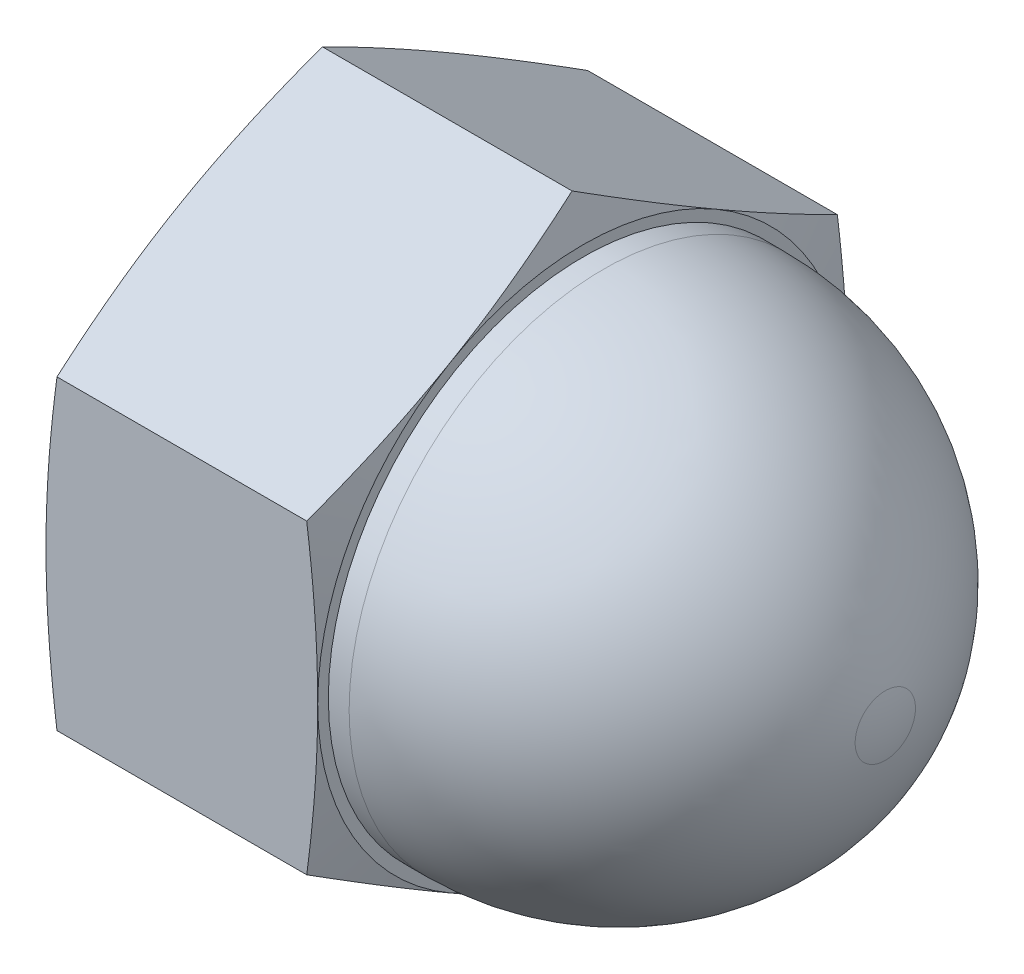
ISO-10303-21;
HEADER;
FILE_DESCRIPTION(('STEP AP214'),'2;1');
FILE_NAME('part.step','',(''),(''),'','','');
FILE_SCHEMA(('AUTOMOTIVE_DESIGN { 1 0 10303 214 1 1 1 1 }'));
ENDSEC;
DATA;
#1=APPLICATION_CONTEXT('core data for automotive mechanical design processes');
#2=APPLICATION_PROTOCOL_DEFINITION('international standard','automotive_design',2000,#1);
#3=PRODUCT_CONTEXT('',#1,'mechanical');
#4=PRODUCT('Part','Part','',(#3));
#5=PRODUCT_RELATED_PRODUCT_CATEGORY('part','',(#4));
#6=PRODUCT_DEFINITION_FORMATION('','',#4);
#7=PRODUCT_DEFINITION_CONTEXT('part definition',#1,'design');
#8=PRODUCT_DEFINITION('design','',#6,#7);
#9=PRODUCT_DEFINITION_SHAPE('','',#8);
#10=(LENGTH_UNIT() NAMED_UNIT(*) SI_UNIT(.MILLI.,.METRE.));
#11=(NAMED_UNIT(*) PLANE_ANGLE_UNIT() SI_UNIT($,.RADIAN.));
#12=(NAMED_UNIT(*) SI_UNIT($,.STERADIAN.) SOLID_ANGLE_UNIT());
#13=UNCERTAINTY_MEASURE_WITH_UNIT(LENGTH_MEASURE(1.E-05),#10,'distance_accuracy_value','');
#14=(GEOMETRIC_REPRESENTATION_CONTEXT(3) GLOBAL_UNCERTAINTY_ASSIGNED_CONTEXT((#13)) GLOBAL_UNIT_ASSIGNED_CONTEXT((#10,
#11,#12)) REPRESENTATION_CONTEXT('',''));
#15=CARTESIAN_POINT('',(0.,0.,0.));
#16=DIRECTION('',(0.,0.,1.));
#17=DIRECTION('',(1.,0.,0.));
#18=AXIS2_PLACEMENT_3D('',#15,#16,#17);
#19=CARTESIAN_POINT('',(0.,2.29135888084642,3.96875));
#20=DIRECTION('',(1.,0.,0.));
#21=DIRECTION('',(0.,0.,-1.));
#22=AXIS2_PLACEMENT_3D('',#19,#20,#21);
#23=PLANE('',#22);
#24=CARTESIAN_POINT('',(0.,0.,0.));
#25=DIRECTION('',(1.,0.,0.));
#26=DIRECTION('',(0.,0.,-1.));
#27=AXIS2_PLACEMENT_3D('',#24,#25,#26);
#28=CIRCLE('',#27,2.0828);
#29=CARTESIAN_POINT('',(0.,0.,-2.0828));
#30=VERTEX_POINT('',#29);
#31=EDGE_CURVE('E40',#30,#30,#28,.T.);
#32=ORIENTED_EDGE('',*,*,#31,.T.);
#33=EDGE_LOOP('',(#32));
#34=FACE_BOUND('',#33,.T.);
#35=CARTESIAN_POINT('',(0.,0.,0.));
#36=DIRECTION('',(1.,0.,0.));
#37=DIRECTION('',(0.,0.,-1.));
#38=AXIS2_PLACEMENT_3D('',#35,#36,#37);
#39=CIRCLE('',#38,3.96875);
#40=CARTESIAN_POINT('',(0.,0.,-3.96875));
#41=VERTEX_POINT('',#40);
#42=CARTESIAN_POINT('',(0.,3.43703832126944,-1.98437500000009));
#43=VERTEX_POINT('',#42);
#44=EDGE_CURVE('E182',#41,#43,#39,.T.);
#45=ORIENTED_EDGE('',*,*,#44,.F.);
#46=CARTESIAN_POINT('',(0.,-3.43703832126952,-1.98437499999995));
#47=VERTEX_POINT('',#46);
#48=EDGE_CURVE('E183',#47,#41,#39,.T.);
#49=ORIENTED_EDGE('',*,*,#48,.F.);
#50=CARTESIAN_POINT('',(0.,-3.43703832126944,1.98437500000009));
#51=VERTEX_POINT('',#50);
#52=EDGE_CURVE('E342',#51,#47,#39,.T.);
#53=ORIENTED_EDGE('',*,*,#52,.F.);
#54=CARTESIAN_POINT('',(0.,0.,3.96875));
#55=VERTEX_POINT('',#54);
#56=EDGE_CURVE('E387',#55,#51,#39,.T.);
#57=ORIENTED_EDGE('',*,*,#56,.F.);
#58=CARTESIAN_POINT('',(0.,0.,0.));
#59=DIRECTION('',(-1.,0.,0.));
#60=DIRECTION('',(0.,0.,1.));
#61=AXIS2_PLACEMENT_3D('',#58,#59,#60);
#62=CIRCLE('',#61,3.96875);
#63=CARTESIAN_POINT('',(0.,3.43703832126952,1.98437499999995));
#64=VERTEX_POINT('',#63);
#65=EDGE_CURVE('E292',#55,#64,#62,.T.);
#66=ORIENTED_EDGE('',*,*,#65,.T.);
#67=EDGE_CURVE('E386',#43,#64,#39,.T.);
#68=ORIENTED_EDGE('',*,*,#67,.F.);
#69=EDGE_LOOP('',(#45,#49,#53,#57,#66,#68));
#70=FACE_BOUND('',#69,.T.);
#71=ADVANCED_FACE('F35',(#34,#70),#23,.F.);
#72=CARTESIAN_POINT('',(4.064,2.29135888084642,3.96875));
#73=DIRECTION('',(1.,0.,0.));
#74=DIRECTION('',(0.,0.,-1.));
#75=AXIS2_PLACEMENT_3D('',#72,#73,#74);
#76=PLANE('',#75);
#77=CARTESIAN_POINT('',(4.064,0.,0.));
#78=DIRECTION('',(1.,0.,0.));
#79=DIRECTION('',(0.,0.,-1.));
#80=AXIS2_PLACEMENT_3D('',#77,#78,#79);
#81=CIRCLE('',#80,3.81);
#82=CARTESIAN_POINT('',(4.064,0.,-3.81));
#83=VERTEX_POINT('',#82);
#84=EDGE_CURVE('E369',#83,#83,#81,.F.);
#85=ORIENTED_EDGE('',*,*,#84,.T.);
#86=EDGE_LOOP('',(#85));
#87=FACE_BOUND('',#86,.T.);
#88=CARTESIAN_POINT('',(4.064,0.,0.));
#89=DIRECTION('',(-1.,0.,0.));
#90=DIRECTION('',(0.,0.,1.));
#91=AXIS2_PLACEMENT_3D('',#88,#89,#90);
#92=CIRCLE('',#91,3.96875);
#93=CARTESIAN_POINT('',(4.064,0.,-3.96875));
#94=VERTEX_POINT('',#93);
#95=CARTESIAN_POINT('',(4.064,-3.43703832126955,-1.98437499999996));
#96=VERTEX_POINT('',#95);
#97=EDGE_CURVE('E289',#94,#96,#92,.T.);
#98=ORIENTED_EDGE('',*,*,#97,.F.);
#99=CARTESIAN_POINT('',(4.064,3.43703832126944,-1.98437500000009));
#100=VERTEX_POINT('',#99);
#101=EDGE_CURVE('E291',#100,#94,#92,.T.);
#102=ORIENTED_EDGE('',*,*,#101,.F.);
#103=CARTESIAN_POINT('',(4.064,3.43703832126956,1.98437499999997));
#104=VERTEX_POINT('',#103);
#105=EDGE_CURVE('E295',#104,#100,#92,.T.);
#106=ORIENTED_EDGE('',*,*,#105,.F.);
#107=CARTESIAN_POINT('',(4.064,0.,3.96875));
#108=VERTEX_POINT('',#107);
#109=EDGE_CURVE('E293',#108,#104,#92,.T.);
#110=ORIENTED_EDGE('',*,*,#109,.F.);
#111=CARTESIAN_POINT('',(4.064,-3.43703832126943,1.98437500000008));
#112=VERTEX_POINT('',#111);
#113=EDGE_CURVE('E53',#112,#108,#92,.T.);
#114=ORIENTED_EDGE('',*,*,#113,.F.);
#115=EDGE_CURVE('E61',#96,#112,#92,.T.);
#116=ORIENTED_EDGE('',*,*,#115,.F.);
#117=EDGE_LOOP('',(#98,#102,#106,#110,#114,#116));
#118=FACE_BOUND('',#117,.T.);
#119=ADVANCED_FACE('F146',(#87,#118),#76,.T.);
#120=CARTESIAN_POINT('',(4.3751590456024,0.,0.));
#121=DIRECTION('',(-1.,0.,0.));
#122=DIRECTION('',(0.,0.,1.));
#123=AXIS2_PLACEMENT_3D('',#120,#121,#122);
#124=DEGENERATE_TOROIDAL_SURFACE('',#123,0.508000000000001,4.318,.F.);
#125=CARTESIAN_POINT('',(4.3751590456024,0.,0.));
#126=DIRECTION('',(-1.,0.,0.));
#127=DIRECTION('',(0.,0.,1.));
#128=AXIS2_PLACEMENT_3D('',#125,#126,#127);
#129=CIRCLE('',#128,3.81);
#130=CARTESIAN_POINT('',(4.3751590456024,0.,3.81));
#131=VERTEX_POINT('',#130);
#132=EDGE_CURVE('E555',#131,#131,#129,.T.);
#133=ORIENTED_EDGE('',*,*,#132,.F.);
#134=EDGE_LOOP('',(#133));
#135=FACE_BOUND('',#134,.T.);
#136=CARTESIAN_POINT('',(8.58519195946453,0.,0.));
#137=DIRECTION('',(-1.,0.,0.));
#138=DIRECTION('',(0.,0.,1.));
#139=AXIS2_PLACEMENT_3D('',#136,#137,#138);
#140=CIRCLE('',#139,0.451555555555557);
#141=CARTESIAN_POINT('',(8.58519195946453,0.,0.451555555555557));
#142=VERTEX_POINT('',#141);
#143=EDGE_CURVE('E558',#142,#142,#140,.T.);
#144=ORIENTED_EDGE('',*,*,#143,.T.);
#145=EDGE_LOOP('',(#144));
#146=FACE_BOUND('',#145,.T.);
#147=ADVANCED_FACE('F152',(#135,#146),#124,.F.);
#148=CARTESIAN_POINT('',(0.,0.,0.));
#149=DIRECTION('',(-1.,0.,0.));
#150=DIRECTION('',(0.,0.,1.));
#151=AXIS2_PLACEMENT_3D('',#148,#149,#150);
#152=CYLINDRICAL_SURFACE('',#151,3.81);
#153=ORIENTED_EDGE('',*,*,#84,.F.);
#154=EDGE_LOOP('',(#153));
#155=FACE_BOUND('',#154,.T.);
#156=ORIENTED_EDGE('',*,*,#132,.T.);
#157=EDGE_LOOP('',(#156));
#158=FACE_BOUND('',#157,.T.);
#159=ADVANCED_FACE('F398',(#155,#158),#152,.T.);
#160=CARTESIAN_POINT('',(6.604,0.,0.));
#161=DIRECTION('',(-1.,0.,0.));
#162=DIRECTION('',(0.,-1.,0.));
#163=AXIS2_PLACEMENT_3D('',#160,#161,#162);
#164=SPHERICAL_SURFACE('',#163,2.032);
#165=ORIENTED_EDGE('',*,*,#143,.F.);
#166=EDGE_LOOP('',(#165));
#167=FACE_BOUND('',#166,.T.);
#168=ADVANCED_FACE('F195',(#167),#164,.T.);
#169=CARTESIAN_POINT('',(2.70107064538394,0.,0.));
#170=DIRECTION('',(-1.,0.,0.));
#171=DIRECTION('',(0.,0.,1.));
#172=AXIS2_PLACEMENT_3D('',#169,#170,#171);
#173=CONICAL_SURFACE('',#172,9.05619537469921,1.30904233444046);
#174=CARTESIAN_POINT('',(3.89948677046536,4.58283323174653,-0.000200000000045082));
#175=CARTESIAN_POINT('',(3.9249928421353,4.48766917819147,0.164628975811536));
#176=CARTESIAN_POINT('',(3.94814818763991,4.39233263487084,0.329756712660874));
#177=CARTESIAN_POINT('',(3.98883000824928,4.20132295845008,0.660595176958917));
#178=CARTESIAN_POINT('',(4.00635419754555,4.10564970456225,0.826306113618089));
#179=CARTESIAN_POINT('',(4.03475064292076,3.91454650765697,1.15730656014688));
#180=CARTESIAN_POINT('',(4.0456567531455,3.819117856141,1.32259383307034));
#181=CARTESIAN_POINT('',(4.06028073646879,3.62813889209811,1.6533791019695));
#182=CARTESIAN_POINT('',(4.06399999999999,3.53258860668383,1.81887705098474));
#183=CARTESIAN_POINT('',(4.06399999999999,3.34148803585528,2.14987294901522));
#184=CARTESIAN_POINT('',(4.06028073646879,3.24593775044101,2.31537089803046));
#185=CARTESIAN_POINT('',(4.0456567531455,3.05495878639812,2.64615616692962));
#186=CARTESIAN_POINT('',(4.03475064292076,2.95953013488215,2.81144343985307));
#187=CARTESIAN_POINT('',(4.00635419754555,2.76842693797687,3.14244388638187));
#188=CARTESIAN_POINT('',(3.98883000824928,2.67275368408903,3.30815482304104));
#189=CARTESIAN_POINT('',(3.94814818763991,2.48174400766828,3.63899328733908));
#190=CARTESIAN_POINT('',(3.9249928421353,2.38640746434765,3.80412102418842));
#191=CARTESIAN_POINT('',(3.89948677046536,2.29124341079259,3.96895));
#192=B_SPLINE_CURVE_WITH_KNOTS('',3,(#174,#175,#176,#177,#178,#179,#180,#181,#182,#183,#184,
#185,#186,#187,#188,#189,#190,#191),.UNSPECIFIED.,.F.,.F.,(4,2,2,2,2,2,2,2,4),(0.,
0.57611882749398,1.15247121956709,1.72584992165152,2.2991176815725,2.87238544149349,
3.44576414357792,4.02211653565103,4.59823536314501),.UNSPECIFIED.);
#193=CARTESIAN_POINT('',(3.8995177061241,4.5827177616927,0.));
#194=VERTEX_POINT('',#193);
#195=EDGE_CURVE('E210',#194,#104,#192,.T.);
#196=ORIENTED_EDGE('',*,*,#195,.T.);
#197=ORIENTED_EDGE('',*,*,#105,.T.);
#198=CARTESIAN_POINT('',(3.89948677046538,2.29124341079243,-3.96895));
#199=CARTESIAN_POINT('',(3.92499284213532,2.3864074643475,-3.80412102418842));
#200=CARTESIAN_POINT('',(3.94814818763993,2.48174400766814,-3.63899328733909));
#201=CARTESIAN_POINT('',(3.9888300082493,2.6727536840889,-3.30815482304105));
#202=CARTESIAN_POINT('',(4.00635419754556,2.76842693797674,-3.14244388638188));
#203=CARTESIAN_POINT('',(4.03475064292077,2.95953013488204,-2.8114434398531));
#204=CARTESIAN_POINT('',(4.04565675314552,3.05495878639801,-2.64615616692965));
#205=CARTESIAN_POINT('',(4.06028073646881,3.24593775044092,-2.31537089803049));
#206=CARTESIAN_POINT('',(4.064,3.3414880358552,-2.14987294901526));
#207=CARTESIAN_POINT('',(4.064,3.53258860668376,-1.81887705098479));
#208=CARTESIAN_POINT('',(4.06028073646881,3.62813889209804,-1.65337910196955));
#209=CARTESIAN_POINT('',(4.04565675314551,3.81911785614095,-1.3225938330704));
#210=CARTESIAN_POINT('',(4.03475064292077,3.91454650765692,-1.15730656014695));
#211=CARTESIAN_POINT('',(4.00635419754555,4.10564970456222,-0.82630611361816));
#212=CARTESIAN_POINT('',(3.98883000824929,4.20132295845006,-0.660595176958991));
#213=CARTESIAN_POINT('',(3.94814818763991,4.39233263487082,-0.329756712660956));
#214=CARTESIAN_POINT('',(3.9249928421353,4.48766917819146,-0.164628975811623));
#215=CARTESIAN_POINT('',(3.89948677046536,4.58283323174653,0.000199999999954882));
#216=B_SPLINE_CURVE_WITH_KNOTS('',3,(#198,#199,#200,#201,#202,#203,#204,#205,#206,#207,#208,
#209,#210,#211,#212,#213,#214,#215),.UNSPECIFIED.,.F.,.F.,(4,2,2,2,2,2,2,2,4),(0.,
0.576118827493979,1.15247121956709,1.72584992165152,2.2991176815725,2.87238544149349,
3.44576414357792,4.02211653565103,4.59823536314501),.UNSPECIFIED.);
#217=EDGE_CURVE('E45',#100,#194,#216,.T.);
#218=ORIENTED_EDGE('',*,*,#217,.T.);
#219=EDGE_LOOP('',(#196,#197,#218));
#220=FACE_BOUND('',#219,.T.);
#221=ADVANCED_FACE('F191',(#220),#173,.T.);
#222=CARTESIAN_POINT('',(3.89951770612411,2.29135888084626,-3.96875));
#223=VERTEX_POINT('',#222);
#224=EDGE_CURVE('E11',#223,#100,#216,.T.);
#225=ORIENTED_EDGE('',*,*,#224,.T.);
#226=ORIENTED_EDGE('',*,*,#101,.T.);
#227=CARTESIAN_POINT('',(3.16755280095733,-6.14470752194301,-3.96875));
#228=CARTESIAN_POINT('',(3.20828431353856,-5.9636649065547,-3.96875));
#229=CARTESIAN_POINT('',(3.24853135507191,-5.7825113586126,-3.96875));
#230=CARTESIAN_POINT('',(3.3277948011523,-5.41992772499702,-3.96875));
#231=CARTESIAN_POINT('',(3.36681115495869,-5.23849762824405,-3.96875));
#232=CARTESIAN_POINT('',(3.44338277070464,-4.87515676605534,-3.96875));
#233=CARTESIAN_POINT('',(3.48093667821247,-4.69324571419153,-3.96875));
#234=CARTESIAN_POINT('',(3.55419142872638,-4.32905106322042,-3.96875));
#235=CARTESIAN_POINT('',(3.58989228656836,-4.14676746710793,-3.96875));
#236=CARTESIAN_POINT('',(3.65871398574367,-3.78326091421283,-3.96875));
#237=CARTESIAN_POINT('',(3.69185359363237,-3.60204152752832,-3.96875));
#238=CARTESIAN_POINT('',(3.75533003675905,-3.23911337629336,-3.96875));
#239=CARTESIAN_POINT('',(3.78566693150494,-3.05740462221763,-3.96875));
#240=CARTESIAN_POINT('',(3.84287264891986,-2.69345279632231,-3.96875));
#241=CARTESIAN_POINT('',(3.86974175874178,-2.51120977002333,-3.96875));
#242=CARTESIAN_POINT('',(3.91923600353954,-2.14613902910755,-3.96875));
#243=CARTESIAN_POINT('',(3.94186107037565,-1.96331130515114,-3.96875));
#244=CARTESIAN_POINT('',(3.98224597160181,-1.59496637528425,-3.96875));
#245=CARTESIAN_POINT('',(3.99994637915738,-1.40944255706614,-3.96875));
#246=CARTESIAN_POINT('',(4.02926987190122,-1.0379232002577,-3.96875));
#247=CARTESIAN_POINT('',(4.04089349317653,-0.851927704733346,-3.96875));
#248=CARTESIAN_POINT('',(4.05738881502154,-0.479721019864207,-3.96875));
#249=CARTESIAN_POINT('',(4.06226375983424,-0.293509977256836,-3.96875));
#250=CARTESIAN_POINT('',(4.06495959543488,0.0789637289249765,-3.96875));
#251=CARTESIAN_POINT('',(4.0627805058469,0.265226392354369,-3.96875));
#252=CARTESIAN_POINT('',(4.05148804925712,0.638274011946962,-3.96875));
#253=CARTESIAN_POINT('',(4.04234730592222,0.825058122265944,-3.96875));
#254=CARTESIAN_POINT('',(4.01765826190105,1.19819852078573,-3.96875));
#255=CARTESIAN_POINT('',(4.00210981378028,1.38455479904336,-3.96875));
#256=CARTESIAN_POINT('',(3.96541106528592,1.7568386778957,-3.96875));
#257=CARTESIAN_POINT('',(3.94425682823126,1.94276588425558,-3.96875));
#258=CARTESIAN_POINT('',(3.89725225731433,2.31401836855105,-3.96875));
#259=CARTESIAN_POINT('',(3.87140191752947,2.49934364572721,-3.96875));
#260=CARTESIAN_POINT('',(3.81491262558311,2.87570961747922,-3.96875));
#261=CARTESIAN_POINT('',(3.78414063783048,3.06673015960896,-3.96875));
#262=CARTESIAN_POINT('',(3.71930087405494,3.44821402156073,-3.96875));
#263=CARTESIAN_POINT('',(3.68523297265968,3.63867731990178,-3.96875));
#264=CARTESIAN_POINT('',(3.61446528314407,4.01913679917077,-3.96875));
#265=CARTESIAN_POINT('',(3.5777651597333,4.20913291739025,-3.96875));
#266=CARTESIAN_POINT('',(3.50226152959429,4.58870789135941,-3.96875));
#267=CARTESIAN_POINT('',(3.46345798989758,4.77828674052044,-3.96875));
#268=CARTESIAN_POINT('',(3.34451485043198,5.34661341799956,-3.96875));
#269=CARTESIAN_POINT('',(3.26186494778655,5.72483500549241,-3.96875));
#270=CARTESIAN_POINT('',(3.09218916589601,6.48029469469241,-3.96875));
#271=CARTESIAN_POINT('',(3.00516317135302,6.85753277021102,-3.96875));
#272=CARTESIAN_POINT('',(2.82913093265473,7.60698906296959,-3.96875));
#273=CARTESIAN_POINT('',(2.74015876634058,7.97921530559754,-3.96875));
#274=CARTESIAN_POINT('',(2.56014248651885,8.7231747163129,-3.96875));
#275=CARTESIAN_POINT('',(2.46909832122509,9.09490787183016,-3.96875));
#276=CARTESIAN_POINT('',(2.28564695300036,9.83743616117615,-3.96875));
#277=CARTESIAN_POINT('',(2.19324203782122,10.2082318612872,-3.96875));
#278=CARTESIAN_POINT('',(2.00729188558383,10.949522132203,-3.96875));
#279=CARTESIAN_POINT('',(1.9137466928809,11.3200167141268,-3.96875));
#280=CARTESIAN_POINT('',(1.81980674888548,11.6904099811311,-3.96875));
#281=B_SPLINE_CURVE_WITH_KNOTS('',3,(#227,#228,#229,#230,#231,#232,#233,#234,#235,#236,#237,
#238,#239,#240,#241,#242,#243,#244,#245,#246,#247,#248,#249,#250,#251,#252,#253,#254,#255,#256,
#257,#258,#259,#260,#261,#262,#263,#264,#265,#266,#267,#268,#269,#270,#271,#272,#273,#274,#275,
#276,#277,#278,#279,#280),.UNSPECIFIED.,.F.,.F.,(4,2,2,2,2,2,2,2,2,2,2,2,2,2,2,2,2,2,2,2,2,2,2,
2,2,2,4),(0.,0.556706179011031,1.11343528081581,1.67066829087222,2.22789683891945,
2.7805530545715,3.33319753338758,3.88579622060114,4.43840377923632,4.99741601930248,
5.55637893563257,6.1150730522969,6.67376561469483,7.2346666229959,7.79558053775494,
8.35688940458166,8.91819897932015,9.49861267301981,10.0790484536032,10.6595583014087,
11.2400772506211,12.4014705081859,13.5628943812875,14.7110215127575,15.8591773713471,
17.0055841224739,18.1519464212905),.UNSPECIFIED.);
#282=EDGE_CURVE('E203',#223,#94,#281,.F.);
#283=ORIENTED_EDGE('',*,*,#282,.F.);
#284=EDGE_LOOP('',(#225,#226,#283));
#285=FACE_BOUND('',#284,.T.);
#286=ADVANCED_FACE('F186',(#285),#173,.T.);
#287=CARTESIAN_POINT('',(3.89948677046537,-4.58283323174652,0.000200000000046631));
#288=CARTESIAN_POINT('',(3.92499284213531,-4.48766917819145,-0.164628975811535));
#289=CARTESIAN_POINT('',(3.94814818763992,-4.39233263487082,-0.329756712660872));
#290=CARTESIAN_POINT('',(3.98883000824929,-4.20132295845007,-0.660595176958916));
#291=CARTESIAN_POINT('',(4.00635419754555,-4.10564970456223,-0.826306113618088));
#292=CARTESIAN_POINT('',(4.03475064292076,-3.91454650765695,-1.15730656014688));
#293=CARTESIAN_POINT('',(4.04565675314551,-3.81911785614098,-1.32259383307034));
#294=CARTESIAN_POINT('',(4.0602807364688,-3.62813889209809,-1.6533791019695));
#295=CARTESIAN_POINT('',(4.06399999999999,-3.53258860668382,-1.81887705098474));
#296=CARTESIAN_POINT('',(4.06399999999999,-3.34148803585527,-2.14987294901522));
#297=CARTESIAN_POINT('',(4.0602807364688,-3.24593775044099,-2.31537089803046));
#298=CARTESIAN_POINT('',(4.04565675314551,-3.0549587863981,-2.64615616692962));
#299=CARTESIAN_POINT('',(4.03475064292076,-2.95953013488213,-2.81144343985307));
#300=CARTESIAN_POINT('',(4.00635419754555,-2.76842693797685,-3.14244388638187));
#301=CARTESIAN_POINT('',(3.98883000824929,-2.67275368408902,-3.30815482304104));
#302=CARTESIAN_POINT('',(3.94814818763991,-2.48174400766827,-3.63899328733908));
#303=CARTESIAN_POINT('',(3.9249928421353,-2.38640746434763,-3.80412102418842));
#304=CARTESIAN_POINT('',(3.89948677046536,-2.29124341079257,-3.96895));
#305=B_SPLINE_CURVE_WITH_KNOTS('',3,(#287,#288,#289,#290,#291,#292,#293,#294,#295,#296,#297,
#298,#299,#300,#301,#302,#303,#304),.UNSPECIFIED.,.F.,.F.,(4,2,2,2,2,2,2,2,4),(0.,
0.57611882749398,1.15247121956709,1.72584992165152,2.2991176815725,2.87238544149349,
3.44576414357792,4.02211653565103,4.59823536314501),.UNSPECIFIED.);
#306=CARTESIAN_POINT('',(3.8995177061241,-2.29135888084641,-3.96875));
#307=VERTEX_POINT('',#306);
#308=EDGE_CURVE('E215',#96,#307,#305,.T.);
#309=ORIENTED_EDGE('',*,*,#308,.T.);
#310=EDGE_CURVE('E267',#94,#307,#281,.F.);
#311=ORIENTED_EDGE('',*,*,#310,.F.);
#312=ORIENTED_EDGE('',*,*,#97,.T.);
#313=EDGE_LOOP('',(#309,#311,#312));
#314=FACE_BOUND('',#313,.T.);
#315=ADVANCED_FACE('F190',(#314),#173,.T.);
#316=CARTESIAN_POINT('',(3.89948677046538,-2.29124341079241,3.96895));
#317=CARTESIAN_POINT('',(3.92499284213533,-2.38640746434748,3.80412102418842));
#318=CARTESIAN_POINT('',(3.94814818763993,-2.48174400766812,3.63899328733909));
#319=CARTESIAN_POINT('',(3.98883000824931,-2.67275368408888,3.30815482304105));
#320=CARTESIAN_POINT('',(4.00635419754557,-2.76842693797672,3.14244388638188));
#321=CARTESIAN_POINT('',(4.03475064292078,-2.95953013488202,2.8114434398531));
#322=CARTESIAN_POINT('',(4.04565675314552,-3.054958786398,2.64615616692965));
#323=CARTESIAN_POINT('',(4.06028073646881,-3.2459377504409,2.31537089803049));
#324=CARTESIAN_POINT('',(4.06400000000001,-3.34148803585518,2.14987294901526));
#325=CARTESIAN_POINT('',(4.064,-3.53258860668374,1.81887705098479));
#326=CARTESIAN_POINT('',(4.06028073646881,-3.62813889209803,1.65337910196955));
#327=CARTESIAN_POINT('',(4.04565675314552,-3.81911785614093,1.3225938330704));
#328=CARTESIAN_POINT('',(4.03475064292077,-3.91454650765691,1.15730656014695));
#329=CARTESIAN_POINT('',(4.00635419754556,-4.1056497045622,0.82630611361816));
#330=CARTESIAN_POINT('',(3.98883000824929,-4.20132295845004,0.660595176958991));
#331=CARTESIAN_POINT('',(3.94814818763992,-4.3923326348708,0.329756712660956));
#332=CARTESIAN_POINT('',(3.92499284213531,-4.48766917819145,0.164628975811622));
#333=CARTESIAN_POINT('',(3.89948677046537,-4.58283323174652,-0.00019999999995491));
#334=B_SPLINE_CURVE_WITH_KNOTS('',3,(#316,#317,#318,#319,#320,#321,#322,#323,#324,#325,#326,
#327,#328,#329,#330,#331,#332,#333),.UNSPECIFIED.,.F.,.F.,(4,2,2,2,2,2,2,2,4),(0.,
0.576118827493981,1.15247121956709,1.72584992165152,2.29911768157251,2.87238544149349,
3.44576414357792,4.02211653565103,4.59823536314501),.UNSPECIFIED.);
#335=CARTESIAN_POINT('',(3.8995177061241,-4.58271776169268,0.));
#336=VERTEX_POINT('',#335);
#337=EDGE_CURVE('E220',#112,#336,#334,.T.);
#338=ORIENTED_EDGE('',*,*,#337,.T.);
#339=EDGE_CURVE('E226',#336,#96,#305,.T.);
#340=ORIENTED_EDGE('',*,*,#339,.T.);
#341=ORIENTED_EDGE('',*,*,#115,.T.);
#342=EDGE_LOOP('',(#338,#340,#341));
#343=FACE_BOUND('',#342,.T.);
#344=ADVANCED_FACE('F279',(#343),#173,.T.);
#345=CARTESIAN_POINT('',(3.16755280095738,-6.14470752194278,3.96875));
#346=CARTESIAN_POINT('',(3.20828431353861,-5.96366490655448,3.96875));
#347=CARTESIAN_POINT('',(3.24853135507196,-5.78251135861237,3.96875));
#348=CARTESIAN_POINT('',(3.32779480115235,-5.41992772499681,3.96875));
#349=CARTESIAN_POINT('',(3.36681115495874,-5.23849762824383,3.96875));
#350=CARTESIAN_POINT('',(3.44338277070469,-4.87515676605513,3.96875));
#351=CARTESIAN_POINT('',(3.48093667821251,-4.69324571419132,3.96875));
#352=CARTESIAN_POINT('',(3.55419142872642,-4.32905106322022,3.96875));
#353=CARTESIAN_POINT('',(3.5898922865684,-4.14676746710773,3.96875));
#354=CARTESIAN_POINT('',(3.6587139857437,-3.78326091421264,3.96875));
#355=CARTESIAN_POINT('',(3.6918535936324,-3.60204152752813,3.96875));
#356=CARTESIAN_POINT('',(3.75533003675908,-3.23911337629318,3.96875));
#357=CARTESIAN_POINT('',(3.78566693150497,-3.05740462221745,3.96875));
#358=CARTESIAN_POINT('',(3.84287264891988,-2.69345279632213,3.96875));
#359=CARTESIAN_POINT('',(3.86974175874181,-2.51120977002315,3.96875));
#360=CARTESIAN_POINT('',(3.91923600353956,-2.14613902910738,3.96875));
#361=CARTESIAN_POINT('',(3.94186107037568,-1.96331130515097,3.96875));
#362=CARTESIAN_POINT('',(3.98224597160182,-1.59496637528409,3.96875));
#363=CARTESIAN_POINT('',(3.99994637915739,-1.40944255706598,3.96875));
#364=CARTESIAN_POINT('',(4.02926987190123,-1.03792320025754,3.96875));
#365=CARTESIAN_POINT('',(4.04089349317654,-0.851927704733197,3.96875));
#366=CARTESIAN_POINT('',(4.05738881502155,-0.479721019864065,3.96875));
#367=CARTESIAN_POINT('',(4.06226375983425,-0.293509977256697,3.96875));
#368=CARTESIAN_POINT('',(4.06495959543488,0.0789637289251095,3.96875));
#369=CARTESIAN_POINT('',(4.0627805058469,0.265226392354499,3.96875));
#370=CARTESIAN_POINT('',(4.05148804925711,0.638274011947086,3.96875));
#371=CARTESIAN_POINT('',(4.04234730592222,0.825058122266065,3.96875));
#372=CARTESIAN_POINT('',(4.01765826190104,1.19819852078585,3.96875));
#373=CARTESIAN_POINT('',(4.00210981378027,1.38455479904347,3.96875));
#374=CARTESIAN_POINT('',(3.96541106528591,1.75683867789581,3.96875));
#375=CARTESIAN_POINT('',(3.94425682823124,1.94276588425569,3.96875));
#376=CARTESIAN_POINT('',(3.89725225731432,2.31401836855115,3.96875));
#377=CARTESIAN_POINT('',(3.87140191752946,2.49934364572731,3.96875));
#378=CARTESIAN_POINT('',(3.8149126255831,2.87570961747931,3.96875));
#379=CARTESIAN_POINT('',(3.78414063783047,3.06673015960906,3.96875));
#380=CARTESIAN_POINT('',(3.71930087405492,3.44821402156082,3.96875));
#381=CARTESIAN_POINT('',(3.68523297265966,3.63867731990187,3.96875));
#382=CARTESIAN_POINT('',(3.61446528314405,4.01913679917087,3.96875));
#383=CARTESIAN_POINT('',(3.57776515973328,4.20913291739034,3.96875));
#384=CARTESIAN_POINT('',(3.50226152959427,4.58870789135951,3.96875));
#385=CARTESIAN_POINT('',(3.46345798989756,4.77828674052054,3.96875));
#386=CARTESIAN_POINT('',(3.34451485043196,5.34661341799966,3.96875));
#387=CARTESIAN_POINT('',(3.26186494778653,5.72483500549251,3.96875));
#388=CARTESIAN_POINT('',(3.09218916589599,6.48029469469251,3.96875));
#389=CARTESIAN_POINT('',(3.005163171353,6.85753277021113,3.96875));
#390=CARTESIAN_POINT('',(2.82913093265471,7.6069890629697,3.96875));
#391=CARTESIAN_POINT('',(2.74015876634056,7.97921530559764,3.96875));
#392=CARTESIAN_POINT('',(2.56014248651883,8.72317471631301,3.96875));
#393=CARTESIAN_POINT('',(2.46909832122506,9.09490787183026,3.96875));
#394=CARTESIAN_POINT('',(2.28564695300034,9.83743616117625,3.96875));
#395=CARTESIAN_POINT('',(2.19324203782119,10.2082318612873,3.96875));
#396=CARTESIAN_POINT('',(2.00729188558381,10.9495221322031,3.96875));
#397=CARTESIAN_POINT('',(1.91374669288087,11.3200167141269,3.96875));
#398=CARTESIAN_POINT('',(1.81980674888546,11.6904099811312,3.96875));
#399=B_SPLINE_CURVE_WITH_KNOTS('',3,(#345,#346,#347,#348,#349,#350,#351,#352,#353,#354,#355,
#356,#357,#358,#359,#360,#361,#362,#363,#364,#365,#366,#367,#368,#369,#370,#371,#372,#373,#374,
#375,#376,#377,#378,#379,#380,#381,#382,#383,#384,#385,#386,#387,#388,#389,#390,#391,#392,#393,
#394,#395,#396,#397,#398),.UNSPECIFIED.,.F.,.F.,(4,2,2,2,2,2,2,2,2,2,2,2,2,2,2,2,2,2,2,2,2,2,2,
2,2,2,4),(0.,0.556706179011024,1.11343528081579,1.6706682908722,2.22789683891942,
2.78055305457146,3.33319753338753,3.88579622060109,4.43840377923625,4.9974160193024,
5.55637893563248,6.1150730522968,6.67376561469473,7.23466662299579,7.79558053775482,
8.35688940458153,8.91819897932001,9.49861267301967,10.079048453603,10.6595583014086,
11.2400772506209,12.4014705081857,13.5628943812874,14.7110215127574,15.859177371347,
17.0055841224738,18.1519464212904),.UNSPECIFIED.);
#400=CARTESIAN_POINT('',(3.89951770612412,-2.29135888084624,3.96875));
#401=VERTEX_POINT('',#400);
#402=EDGE_CURVE('E227',#108,#401,#399,.F.);
#403=ORIENTED_EDGE('',*,*,#402,.T.);
#404=EDGE_CURVE('E225',#401,#112,#334,.T.);
#405=ORIENTED_EDGE('',*,*,#404,.T.);
#406=ORIENTED_EDGE('',*,*,#113,.T.);
#407=EDGE_LOOP('',(#403,#405,#406));
#408=FACE_BOUND('',#407,.T.);
#409=ADVANCED_FACE('F404',(#408),#173,.T.);
#410=CARTESIAN_POINT('',(3.89951770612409,2.29135888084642,3.96875));
#411=VERTEX_POINT('',#410);
#412=EDGE_CURVE('E273',#104,#411,#192,.T.);
#413=ORIENTED_EDGE('',*,*,#412,.T.);
#414=EDGE_CURVE('E381',#411,#108,#399,.F.);
#415=ORIENTED_EDGE('',*,*,#414,.T.);
#416=ORIENTED_EDGE('',*,*,#109,.T.);
#417=EDGE_LOOP('',(#413,#415,#416));
#418=FACE_BOUND('',#417,.T.);
#419=ADVANCED_FACE('F164',(#418),#173,.T.);
#420=CARTESIAN_POINT('',(4.064,2.29135888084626,-3.96875));
#421=DIRECTION('',(0.,-0.866025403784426,0.500000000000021));
#422=DIRECTION('',(0.,-0.500000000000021,-0.866025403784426));
#423=AXIS2_PLACEMENT_3D('',#420,#421,#422);
#424=PLANE('',#423);
#425=ORIENTED_EDGE('',*,*,#224,.F.);
#426=DIRECTION('',(-1.,0.,0.));
#427=VECTOR('',#426,1.);
#428=CARTESIAN_POINT('',(4.064,2.29135888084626,-3.96875));
#429=LINE('',#428,#427);
#430=CARTESIAN_POINT('',(0.164512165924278,2.29135888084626,-3.96875));
#431=VERTEX_POINT('',#430);
#432=EDGE_CURVE('E364',#223,#431,#429,.T.);
#433=ORIENTED_EDGE('',*,*,#432,.T.);
#434=CARTESIAN_POINT('',(0.164543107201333,4.58283323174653,0.000199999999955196));
#435=CARTESIAN_POINT('',(0.139032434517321,4.48766929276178,-0.164628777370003));
#436=CARTESIAN_POINT('',(0.115872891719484,4.39233280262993,-0.329756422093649));
#437=CARTESIAN_POINT('',(0.0751836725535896,4.20132311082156,-0.660594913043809));
#438=CARTESIAN_POINT('',(0.0576562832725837,4.1056497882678,-0.826305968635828));
#439=CARTESIAN_POINT('',(0.029254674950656,3.91454654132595,-1.15730650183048));
#440=CARTESIAN_POINT('',(0.0183465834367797,3.81911790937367,-1.32259374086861));
#441=CARTESIAN_POINT('',(0.00371994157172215,3.62813894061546,-1.65337901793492));
#442=CARTESIAN_POINT('',(0.,3.53258863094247,-1.81887700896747));
#443=CARTESIAN_POINT('',(0.,3.34148801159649,-2.14987299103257));
#444=CARTESIAN_POINT('',(0.00371994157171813,3.2459377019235,-2.31537098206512));
#445=CARTESIAN_POINT('',(0.0183465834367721,3.05495873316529,-2.64615625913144));
#446=CARTESIAN_POINT('',(0.0292546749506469,2.95953010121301,-2.81144349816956));
#447=CARTESIAN_POINT('',(0.0576562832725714,2.76842685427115,-3.14244403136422));
#448=CARTESIAN_POINT('',(0.0751836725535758,2.6727535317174,-3.30815508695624));
#449=CARTESIAN_POINT('',(0.115872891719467,2.48174383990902,-3.6389935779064));
#450=CARTESIAN_POINT('',(0.139032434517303,2.38640734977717,-3.80412122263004));
#451=CARTESIAN_POINT('',(0.164543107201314,2.29124341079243,-3.96895));
#452=B_SPLINE_CURVE_WITH_KNOTS('',3,(#434,#435,#436,#437,#438,#439,#440,#441,#442,#443,#444,
#445,#446,#447,#448,#449,#450,#451),.UNSPECIFIED.,.F.,.F.,(4,2,2,2,2,2,2,2,4),(0.,
0.576119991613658,1.15247363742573,1.7258525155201,2.29912040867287,2.87238830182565,
3.44576717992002,4.02212082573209,4.59824081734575),.UNSPECIFIED.);
#453=EDGE_CURVE('E170',#43,#431,#452,.T.);
#454=ORIENTED_EDGE('',*,*,#453,.F.);
#455=CARTESIAN_POINT('',(0.164512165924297,4.5827177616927,0.));
#456=VERTEX_POINT('',#455);
#457=EDGE_CURVE('E355',#456,#43,#452,.T.);
#458=ORIENTED_EDGE('',*,*,#457,.F.);
#459=DIRECTION('',(-1.,0.,0.));
#460=VECTOR('',#459,1.);
#461=CARTESIAN_POINT('',(4.064,4.5827177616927,0.));
#462=LINE('',#461,#460);
#463=EDGE_CURVE('E366',#194,#456,#462,.T.);
#464=ORIENTED_EDGE('',*,*,#463,.F.);
#465=ORIENTED_EDGE('',*,*,#217,.F.);
#466=EDGE_LOOP('',(#425,#433,#454,#458,#464,#465));
#467=FACE_BOUND('',#466,.T.);
#468=ADVANCED_FACE('F159',(#467),#424,.F.);
#469=CARTESIAN_POINT('',(4.064,2.29135888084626,-3.96875));
#470=DIRECTION('',(0.,0.,-1.));
#471=DIRECTION('',(-1.,0.,0.));
#472=AXIS2_PLACEMENT_3D('',#469,#470,#471);
#473=PLANE('',#472);
#474=ORIENTED_EDGE('',*,*,#432,.F.);
#475=ORIENTED_EDGE('',*,*,#282,.T.);
#476=ORIENTED_EDGE('',*,*,#310,.T.);
#477=DIRECTION('',(-1.,0.,0.));
#478=VECTOR('',#477,1.);
#479=CARTESIAN_POINT('',(4.064,-2.2913588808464,-3.96875));
#480=LINE('',#479,#478);
#481=CARTESIAN_POINT('',(0.164512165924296,-2.29135888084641,-3.96875));
#482=VERTEX_POINT('',#481);
#483=EDGE_CURVE('E285',#307,#482,#480,.T.);
#484=ORIENTED_EDGE('',*,*,#483,.T.);
#485=CARTESIAN_POINT('',(0.89661789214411,-6.14474256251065,-3.96875));
#486=CARTESIAN_POINT('',(0.855878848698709,-5.96369965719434,-3.96875));
#487=CARTESIAN_POINT('',(0.815624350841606,-5.7825457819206,-3.96875));
#488=CARTESIAN_POINT('',(0.736346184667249,-5.41996139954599,-3.96875));
#489=CARTESIAN_POINT('',(0.697322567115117,-5.23853088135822,-3.96875));
#490=CARTESIAN_POINT('',(0.620736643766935,-4.87518901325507,-3.96875));
#491=CARTESIAN_POINT('',(0.583175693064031,-4.69327737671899,-3.96875));
#492=CARTESIAN_POINT('',(0.509907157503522,-4.32908142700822,-3.96875));
#493=CARTESIAN_POINT('',(0.474199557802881,-4.14679711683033,-3.96875));
#494=CARTESIAN_POINT('',(0.405364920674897,-3.7832895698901,-3.96875));
#495=CARTESIAN_POINT('',(0.372219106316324,-3.6020699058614,-3.96875));
#496=CARTESIAN_POINT('',(0.30873070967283,-3.23914102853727,-3.96875));
#497=CARTESIAN_POINT('',(0.278388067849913,-3.05743182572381,-3.96875));
#498=CARTESIAN_POINT('',(0.221171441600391,-2.6934789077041,-3.96875));
#499=CARTESIAN_POINT('',(0.194297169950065,-2.51123523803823,-3.96875));
#500=CARTESIAN_POINT('',(0.144793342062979,-2.14616299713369,-3.96875));
#501=CARTESIAN_POINT('',(0.122163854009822,-1.96333441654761,-3.96875));
#502=CARTESIAN_POINT('',(0.0817708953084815,-1.59498670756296,-3.96875));
#503=CARTESIAN_POINT('',(0.064066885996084,-1.40946096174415,-3.96875));
#504=CARTESIAN_POINT('',(0.0347373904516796,-1.03793756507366,-3.96875));
#505=CARTESIAN_POINT('',(0.0231113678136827,-0.851939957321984,-3.96875));
#506=CARTESIAN_POINT('',(0.00661261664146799,-0.479728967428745,-3.96875));
#507=CARTESIAN_POINT('',(0.00173664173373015,-0.293515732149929,-3.96875));
#508=CARTESIAN_POINT('',(-0.000959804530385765,0.0789623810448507,-3.96875));
#509=CARTESIAN_POINT('',(0.00121970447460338,0.265227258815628,-3.96875));
#510=CARTESIAN_POINT('',(0.0125144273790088,0.638279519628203,-3.96875));
#511=CARTESIAN_POINT('',(0.0216570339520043,0.825066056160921,-3.96875));
#512=CARTESIAN_POINT('',(0.0463511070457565,1.19821113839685,-3.96875));
#513=CARTESIAN_POINT('',(0.0619027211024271,1.38456967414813,-3.96875));
#514=CARTESIAN_POINT('',(0.0986089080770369,1.75685791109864,-3.96875));
#515=CARTESIAN_POINT('',(0.119767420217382,1.94278721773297,-3.96875));
#516=CARTESIAN_POINT('',(0.166781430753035,2.31404367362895,-3.96875));
#517=CARTESIAN_POINT('',(0.192636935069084,2.49937082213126,-3.96875));
#518=CARTESIAN_POINT('',(0.24913817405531,2.87574525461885,-3.96875));
#519=CARTESIAN_POINT('',(0.279917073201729,3.0667723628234,-3.96875));
#520=CARTESIAN_POINT('',(0.344771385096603,3.44826912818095,-3.96875));
#521=CARTESIAN_POINT('',(0.378846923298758,3.63873876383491,-3.96875));
#522=CARTESIAN_POINT('',(0.449630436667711,4.01921073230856,-3.96875));
#523=CARTESIAN_POINT('',(0.486338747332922,4.20921300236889,-3.96875));
#524=CARTESIAN_POINT('',(0.561859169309,4.58880011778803,-3.96875));
#525=CARTESIAN_POINT('',(0.600671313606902,4.77838495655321,-3.96875));
#526=CARTESIAN_POINT('',(0.719640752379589,5.34672943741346,-3.96875));
#527=CARTESIAN_POINT('',(0.802308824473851,5.72496263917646,-3.96875));
#528=CARTESIAN_POINT('',(0.972021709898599,6.48044519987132,-3.96875));
#529=CARTESIAN_POINT('',(1.05906663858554,6.85769453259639,-3.96875));
#530=CARTESIAN_POINT('',(1.23513660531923,7.60717119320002,-3.96875));
#531=CARTESIAN_POINT('',(1.32412754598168,7.97940655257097,-3.96875));
#532=CARTESIAN_POINT('',(1.50418168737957,8.72338403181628,-3.96875));
#533=CARTESIAN_POINT('',(1.59524493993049,9.09512613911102,-3.96875));
#534=CARTESIAN_POINT('',(1.77873462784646,9.83767200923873,-3.96875));
#535=CARTESIAN_POINT('',(1.87115877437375,10.2084763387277,-3.96875));
#536=CARTESIAN_POINT('',(2.0571475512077,10.9497837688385,-3.96875));
#537=CARTESIAN_POINT('',(2.15071213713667,11.320286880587,-3.96875));
#538=CARTESIAN_POINT('',(2.24467152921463,11.6906886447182,-3.96875));
#539=B_SPLINE_CURVE_WITH_KNOTS('',3,(#485,#486,#487,#488,#489,#490,#491,#492,#493,#494,#495,
#496,#497,#498,#499,#500,#501,#502,#503,#504,#505,#506,#507,#508,#509,#510,#511,#512,#513,#514,
#515,#516,#517,#518,#519,#520,#521,#522,#523,#524,#525,#526,#527,#528,#529,#530,#531,#532,#533,
#534,#535,#536,#537,#538),.UNSPECIFIED.,.F.,.F.,(4,2,2,2,2,2,2,2,2,2,2,2,2,2,2,2,2,2,2,2,2,2,2,
2,2,2,4),(0.,0.556711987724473,1.11344690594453,1.67068590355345,2.22792043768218,
2.7805808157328,3.3332294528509,3.88583229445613,4.43844401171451,4.99746300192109,
5.55643264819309,6.11513336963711,6.67383253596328,7.23474103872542,7.79566245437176,
8.35697900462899,8.91829626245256,9.49873268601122,10.079191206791,10.659723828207,
11.240265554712,12.4017044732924,13.5631740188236,14.7113408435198,15.8595364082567,
17.0059822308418,18.1523835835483),.UNSPECIFIED.);
#540=EDGE_CURVE('E338',#482,#41,#539,.T.);
#541=ORIENTED_EDGE('',*,*,#540,.T.);
#542=EDGE_CURVE('E350',#41,#431,#539,.T.);
#543=ORIENTED_EDGE('',*,*,#542,.T.);
#544=EDGE_LOOP('',(#474,#475,#476,#484,#541,#543));
#545=FACE_BOUND('',#544,.T.);
#546=ADVANCED_FACE('F163',(#545),#473,.T.);
#547=CARTESIAN_POINT('',(4.064,-4.58271776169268,0.));
#548=DIRECTION('',(0.,0.866025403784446,0.499999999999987));
#549=DIRECTION('',(0.,-0.499999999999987,0.866025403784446));
#550=AXIS2_PLACEMENT_3D('',#547,#548,#549);
#551=PLANE('',#550);
#552=ORIENTED_EDGE('',*,*,#339,.F.);
#553=DIRECTION('',(-1.,0.,0.));
#554=VECTOR('',#553,1.);
#555=CARTESIAN_POINT('',(4.064,-4.58271776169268,0.));
#556=LINE('',#555,#554);
#557=CARTESIAN_POINT('',(0.164512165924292,-4.58271776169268,0.));
#558=VERTEX_POINT('',#557);
#559=EDGE_CURVE('E344',#336,#558,#556,.T.);
#560=ORIENTED_EDGE('',*,*,#559,.T.);
#561=CARTESIAN_POINT('',(0.164543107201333,-2.29124341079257,-3.96895));
#562=CARTESIAN_POINT('',(0.139032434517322,-2.38640734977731,-3.80412122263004));
#563=CARTESIAN_POINT('',(0.115872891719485,-2.48174383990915,-3.63899357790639));
#564=CARTESIAN_POINT('',(0.0751836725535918,-2.67275353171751,-3.30815508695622));
#565=CARTESIAN_POINT('',(0.0576562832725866,-2.76842685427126,-3.1424440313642));
#566=CARTESIAN_POINT('',(0.0292546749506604,-2.95953010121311,-2.81144349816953));
#567=CARTESIAN_POINT('',(0.0183465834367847,-3.05495873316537,-2.64615625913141));
#568=CARTESIAN_POINT('',(0.00371994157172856,-3.24593770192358,-2.31537098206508));
#569=CARTESIAN_POINT('',(0.,-3.34148801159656,-2.14987299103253));
#570=CARTESIAN_POINT('',(0.,-3.53258863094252,-1.81887700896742));
#571=CARTESIAN_POINT('',(0.00371994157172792,-3.62813894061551,-1.65337901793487));
#572=CARTESIAN_POINT('',(0.0183465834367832,-3.81911790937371,-1.32259374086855));
#573=CARTESIAN_POINT('',(0.0292546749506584,-3.91454654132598,-1.15730650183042));
#574=CARTESIAN_POINT('',(0.0576562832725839,-4.10564978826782,-0.826305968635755));
#575=CARTESIAN_POINT('',(0.0751836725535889,-4.20132311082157,-0.660594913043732));
#576=CARTESIAN_POINT('',(0.115872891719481,-4.39233280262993,-0.329756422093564));
#577=CARTESIAN_POINT('',(0.139032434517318,-4.48766929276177,-0.164628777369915));
#578=CARTESIAN_POINT('',(0.164543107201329,-4.58283323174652,0.000200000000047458));
#579=B_SPLINE_CURVE_WITH_KNOTS('',3,(#561,#562,#563,#564,#565,#566,#567,#568,#569,#570,#571,
#572,#573,#574,#575,#576,#577,#578),.UNSPECIFIED.,.F.,.F.,(4,2,2,2,2,2,2,2,4),(0.,
0.576119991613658,1.15247363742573,1.7258525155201,2.29912040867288,2.87238830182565,
3.44576717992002,4.02212082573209,4.59824081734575),.UNSPECIFIED.);
#580=EDGE_CURVE('E248',#47,#558,#579,.T.);
#581=ORIENTED_EDGE('',*,*,#580,.F.);
#582=EDGE_CURVE('E334',#482,#47,#579,.T.);
#583=ORIENTED_EDGE('',*,*,#582,.F.);
#584=ORIENTED_EDGE('',*,*,#483,.F.);
#585=ORIENTED_EDGE('',*,*,#308,.F.);
#586=EDGE_LOOP('',(#552,#560,#581,#583,#584,#585));
#587=FACE_BOUND('',#586,.T.);
#588=ADVANCED_FACE('F236',(#587),#551,.F.);
#589=CARTESIAN_POINT('',(4.064,-2.29135888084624,3.96875));
#590=DIRECTION('',(0.,0.866025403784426,-0.500000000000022));
#591=DIRECTION('',(0.,0.500000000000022,0.866025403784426));
#592=AXIS2_PLACEMENT_3D('',#589,#590,#591);
#593=PLANE('',#592);
#594=ORIENTED_EDGE('',*,*,#404,.F.);
#595=DIRECTION('',(-1.,0.,0.));
#596=VECTOR('',#595,1.);
#597=CARTESIAN_POINT('',(4.064,-2.29135888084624,3.96875));
#598=LINE('',#597,#596);
#599=CARTESIAN_POINT('',(0.164512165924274,-2.29135888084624,3.96875));
#600=VERTEX_POINT('',#599);
#601=EDGE_CURVE('E374',#401,#600,#598,.T.);
#602=ORIENTED_EDGE('',*,*,#601,.T.);
#603=CARTESIAN_POINT('',(0.164543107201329,-4.58283323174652,-0.000199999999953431));
#604=CARTESIAN_POINT('',(0.139032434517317,-4.48766929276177,0.164628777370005));
#605=CARTESIAN_POINT('',(0.115872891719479,-4.39233280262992,0.32975642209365));
#606=CARTESIAN_POINT('',(0.0751836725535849,-4.20132311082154,0.66059491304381));
#607=CARTESIAN_POINT('',(0.057656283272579,-4.10564978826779,0.826305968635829));
#608=CARTESIAN_POINT('',(0.0292546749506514,-3.91454654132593,1.15730650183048));
#609=CARTESIAN_POINT('',(0.0183465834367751,-3.81911790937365,1.32259374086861));
#610=CARTESIAN_POINT('',(0.00371994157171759,-3.62813894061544,1.65337901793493));
#611=CARTESIAN_POINT('',(0.,-3.53258863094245,1.81887700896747));
#612=CARTESIAN_POINT('',(0.,-3.34148801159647,2.14987299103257));
#613=CARTESIAN_POINT('',(0.00371994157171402,-3.24593770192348,2.31537098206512));
#614=CARTESIAN_POINT('',(0.0183465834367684,-3.05495873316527,2.64615625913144));
#615=CARTESIAN_POINT('',(0.0292546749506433,-2.95953010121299,2.81144349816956));
#616=CARTESIAN_POINT('',(0.0576562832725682,-2.76842685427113,3.14244403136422));
#617=CARTESIAN_POINT('',(0.0751836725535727,-2.67275353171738,3.30815508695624));
#618=CARTESIAN_POINT('',(0.115872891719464,-2.481743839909,3.6389935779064));
#619=CARTESIAN_POINT('',(0.1390324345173,-2.38640734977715,3.80412122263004));
#620=CARTESIAN_POINT('',(0.164543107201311,-2.29124341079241,3.96895));
#621=B_SPLINE_CURVE_WITH_KNOTS('',3,(#603,#604,#605,#606,#607,#608,#609,#610,#611,#612,#613,
#614,#615,#616,#617,#618,#619,#620),.UNSPECIFIED.,.F.,.F.,(4,2,2,2,2,2,2,2,4),(0.,
0.576119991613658,1.15247363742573,1.7258525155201,2.29912040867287,2.87238830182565,
3.44576717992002,4.02212082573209,4.59824081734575),.UNSPECIFIED.);
#622=EDGE_CURVE('E249',#51,#600,#621,.T.);
#623=ORIENTED_EDGE('',*,*,#622,.F.);
#624=EDGE_CURVE('E242',#558,#51,#621,.T.);
#625=ORIENTED_EDGE('',*,*,#624,.F.);
#626=ORIENTED_EDGE('',*,*,#559,.F.);
#627=ORIENTED_EDGE('',*,*,#337,.F.);
#628=EDGE_LOOP('',(#594,#602,#623,#625,#626,#627));
#629=FACE_BOUND('',#628,.T.);
#630=ADVANCED_FACE('F232',(#629),#593,.F.);
#631=CARTESIAN_POINT('',(4.064,2.29135888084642,3.96875));
#632=DIRECTION('',(0.,0.,-1.));
#633=DIRECTION('',(-1.,0.,0.));
#634=AXIS2_PLACEMENT_3D('',#631,#632,#633);
#635=PLANE('',#634);
#636=ORIENTED_EDGE('',*,*,#414,.F.);
#637=DIRECTION('',(-1.,0.,0.));
#638=VECTOR('',#637,1.);
#639=CARTESIAN_POINT('',(4.064,2.29135888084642,3.96875));
#640=LINE('',#639,#638);
#641=CARTESIAN_POINT('',(0.164512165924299,2.29135888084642,3.96875));
#642=VERTEX_POINT('',#641);
#643=EDGE_CURVE('E343',#411,#642,#640,.T.);
#644=ORIENTED_EDGE('',*,*,#643,.T.);
#645=CARTESIAN_POINT('',(0.896617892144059,-6.14474256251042,3.96875));
#646=CARTESIAN_POINT('',(0.855878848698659,-5.96369965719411,3.96875));
#647=CARTESIAN_POINT('',(0.815624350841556,-5.78254578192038,3.96875));
#648=CARTESIAN_POINT('',(0.736346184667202,-5.41996139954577,3.96875));
#649=CARTESIAN_POINT('',(0.697322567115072,-5.238530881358,3.96875));
#650=CARTESIAN_POINT('',(0.620736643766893,-4.87518901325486,3.96875));
#651=CARTESIAN_POINT('',(0.583175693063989,-4.69327737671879,3.96875));
#652=CARTESIAN_POINT('',(0.509907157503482,-4.32908142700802,3.96875));
#653=CARTESIAN_POINT('',(0.474199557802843,-4.14679711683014,3.96875));
#654=CARTESIAN_POINT('',(0.405364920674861,-3.78328956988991,3.96875));
#655=CARTESIAN_POINT('',(0.37221910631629,-3.60206990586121,3.96875));
#656=CARTESIAN_POINT('',(0.308730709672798,-3.23914102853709,3.96875));
#657=CARTESIAN_POINT('',(0.278388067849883,-3.05743182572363,3.96875));
#658=CARTESIAN_POINT('',(0.221171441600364,-2.69347890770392,3.96875));
#659=CARTESIAN_POINT('',(0.19429716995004,-2.51123523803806,3.96875));
#660=CARTESIAN_POINT('',(0.144793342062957,-2.14616299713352,3.96875));
#661=CARTESIAN_POINT('',(0.122163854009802,-1.96333441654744,3.96875));
#662=CARTESIAN_POINT('',(0.0817708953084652,-1.5949867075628,3.96875));
#663=CARTESIAN_POINT('',(0.0640668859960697,-1.40946096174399,3.96875));
#664=CARTESIAN_POINT('',(0.0347373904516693,-1.03793756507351,3.96875));
#665=CARTESIAN_POINT('',(0.0231113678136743,-0.851939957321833,3.96875));
#666=CARTESIAN_POINT('',(0.00661261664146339,-0.4797289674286,3.96875));
#667=CARTESIAN_POINT('',(0.00173664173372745,-0.293515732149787,3.96875));
#668=CARTESIAN_POINT('',(-0.000959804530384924,0.0789623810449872,3.96875));
#669=CARTESIAN_POINT('',(0.00121970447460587,0.265227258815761,3.96875));
#670=CARTESIAN_POINT('',(0.0125144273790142,0.63827951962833,3.96875));
#671=CARTESIAN_POINT('',(0.021657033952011,0.825066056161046,3.96875));
#672=CARTESIAN_POINT('',(0.0463511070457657,1.19821113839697,3.96875));
#673=CARTESIAN_POINT('',(0.0619027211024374,1.38456967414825,3.96875));
#674=CARTESIAN_POINT('',(0.0986089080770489,1.75685791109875,3.96875));
#675=CARTESIAN_POINT('',(0.119767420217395,1.94278721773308,3.96875));
#676=CARTESIAN_POINT('',(0.166781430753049,2.31404367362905,3.96875));
#677=CARTESIAN_POINT('',(0.192636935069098,2.49937082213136,3.96875));
#678=CARTESIAN_POINT('',(0.249138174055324,2.87574525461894,3.96875));
#679=CARTESIAN_POINT('',(0.279917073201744,3.06677236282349,3.96875));
#680=CARTESIAN_POINT('',(0.344771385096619,3.44826912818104,3.96875));
#681=CARTESIAN_POINT('',(0.378846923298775,3.63873876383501,3.96875));
#682=CARTESIAN_POINT('',(0.449630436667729,4.01921073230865,3.96875));
#683=CARTESIAN_POINT('',(0.48633874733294,4.20921300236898,3.96875));
#684=CARTESIAN_POINT('',(0.561859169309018,4.58880011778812,3.96875));
#685=CARTESIAN_POINT('',(0.60067131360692,4.7783849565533,3.96875));
#686=CARTESIAN_POINT('',(0.719640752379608,5.34672943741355,3.96875));
#687=CARTESIAN_POINT('',(0.80230882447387,5.72496263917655,3.96875));
#688=CARTESIAN_POINT('',(0.972021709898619,6.48044519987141,3.96875));
#689=CARTESIAN_POINT('',(1.05906663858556,6.85769453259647,3.96875));
#690=CARTESIAN_POINT('',(1.23513660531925,7.60717119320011,3.96875));
#691=CARTESIAN_POINT('',(1.3241275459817,7.97940655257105,3.96875));
#692=CARTESIAN_POINT('',(1.50418168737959,8.72338403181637,3.96875));
#693=CARTESIAN_POINT('',(1.59524493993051,9.09512613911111,3.96875));
#694=CARTESIAN_POINT('',(1.77873462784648,9.83767200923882,3.96875));
#695=CARTESIAN_POINT('',(1.87115877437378,10.2084763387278,3.96875));
#696=CARTESIAN_POINT('',(2.05714755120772,10.9497837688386,3.96875));
#697=CARTESIAN_POINT('',(2.15071213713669,11.3202868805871,3.96875));
#698=CARTESIAN_POINT('',(2.24467152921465,11.6906886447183,3.96875));
#699=B_SPLINE_CURVE_WITH_KNOTS('',3,(#645,#646,#647,#648,#649,#650,#651,#652,#653,#654,#655,
#656,#657,#658,#659,#660,#661,#662,#663,#664,#665,#666,#667,#668,#669,#670,#671,#672,#673,#674,
#675,#676,#677,#678,#679,#680,#681,#682,#683,#684,#685,#686,#687,#688,#689,#690,#691,#692,#693,
#694,#695,#696,#697,#698),.UNSPECIFIED.,.F.,.F.,(4,2,2,2,2,2,2,2,2,2,2,2,2,2,2,2,2,2,2,2,2,2,2,
2,2,2,4),(0.,0.556711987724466,1.11344690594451,1.67068590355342,2.22792043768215,
2.78058081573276,3.33322945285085,3.88583229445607,4.43844401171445,4.99746300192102,
5.55643264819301,6.11513336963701,6.67383253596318,7.23474103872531,7.79566245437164,
8.35697900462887,8.91829626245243,9.49873268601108,10.0791912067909,10.6597238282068,
11.2402655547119,12.4017044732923,13.5631740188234,14.7113408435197,15.8595364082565,
17.0059822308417,18.1523835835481),.UNSPECIFIED.);
#700=EDGE_CURVE('E247',#55,#642,#699,.T.);
#701=ORIENTED_EDGE('',*,*,#700,.F.);
#702=EDGE_CURVE('E258',#600,#55,#699,.T.);
#703=ORIENTED_EDGE('',*,*,#702,.F.);
#704=ORIENTED_EDGE('',*,*,#601,.F.);
#705=ORIENTED_EDGE('',*,*,#402,.F.);
#706=EDGE_LOOP('',(#636,#644,#701,#703,#704,#705));
#707=FACE_BOUND('',#706,.T.);
#708=ADVANCED_FACE('F235',(#707),#635,.F.);
#709=CARTESIAN_POINT('',(4.064,4.5827177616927,0.));
#710=DIRECTION('',(0.,-0.866025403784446,-0.499999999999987));
#711=DIRECTION('',(0.,0.499999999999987,-0.866025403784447));
#712=AXIS2_PLACEMENT_3D('',#709,#710,#711);
#713=PLANE('',#712);
#714=ORIENTED_EDGE('',*,*,#195,.F.);
#715=ORIENTED_EDGE('',*,*,#463,.T.);
#716=CARTESIAN_POINT('',(0.164543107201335,2.29124341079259,3.96895));
#717=CARTESIAN_POINT('',(0.139032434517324,2.38640734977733,3.80412122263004));
#718=CARTESIAN_POINT('',(0.115872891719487,2.48174383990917,3.63899357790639));
#719=CARTESIAN_POINT('',(0.0751836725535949,2.67275353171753,3.30815508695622));
#720=CARTESIAN_POINT('',(0.05765628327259,2.76842685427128,3.1424440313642));
#721=CARTESIAN_POINT('',(0.0292546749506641,2.95953010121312,2.81144349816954));
#722=CARTESIAN_POINT('',(0.0183465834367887,3.05495873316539,2.64615625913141));
#723=CARTESIAN_POINT('',(0.00371994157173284,3.24593770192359,2.31537098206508));
#724=CARTESIAN_POINT('',(0.,3.34148801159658,2.14987299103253));
#725=CARTESIAN_POINT('',(0.,3.53258863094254,1.81887700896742));
#726=CARTESIAN_POINT('',(0.00371994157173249,3.62813894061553,1.65337901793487));
#727=CARTESIAN_POINT('',(0.0183465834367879,3.81911790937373,1.32259374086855));
#728=CARTESIAN_POINT('',(0.0292546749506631,3.914546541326,1.15730650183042));
#729=CARTESIAN_POINT('',(0.0576562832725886,4.10564978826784,0.826305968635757));
#730=CARTESIAN_POINT('',(0.0751836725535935,4.20132311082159,0.660594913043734));
#731=CARTESIAN_POINT('',(0.115872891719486,4.39233280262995,0.329756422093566));
#732=CARTESIAN_POINT('',(0.139032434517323,4.48766929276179,0.164628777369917));
#733=CARTESIAN_POINT('',(0.164543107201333,4.58283323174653,-0.000200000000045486));
#734=B_SPLINE_CURVE_WITH_KNOTS('',3,(#716,#717,#718,#719,#720,#721,#722,#723,#724,#725,#726,
#727,#728,#729,#730,#731,#732,#733),.UNSPECIFIED.,.F.,.F.,(4,2,2,2,2,2,2,2,4),(0.,
0.576119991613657,1.15247363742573,1.7258525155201,2.29912040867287,2.87238830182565,
3.44576717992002,4.02212082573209,4.59824081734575),.UNSPECIFIED.);
#735=EDGE_CURVE('E250',#64,#456,#734,.T.);
#736=ORIENTED_EDGE('',*,*,#735,.F.);
#737=EDGE_CURVE('E346',#642,#64,#734,.T.);
#738=ORIENTED_EDGE('',*,*,#737,.F.);
#739=ORIENTED_EDGE('',*,*,#643,.F.);
#740=ORIENTED_EDGE('',*,*,#412,.F.);
#741=EDGE_LOOP('',(#714,#715,#736,#738,#739,#740));
#742=FACE_BOUND('',#741,.T.);
#743=ADVANCED_FACE('F37',(#742),#713,.F.);
#744=CARTESIAN_POINT('',(0.,0.,0.));
#745=DIRECTION('',(1.,0.,0.));
#746=DIRECTION('',(0.,0.,-1.));
#747=AXIS2_PLACEMENT_3D('',#744,#745,#746);
#748=CONICAL_SURFACE('',#747,3.96875,1.30899693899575);
#749=ORIENTED_EDGE('',*,*,#582,.T.);
#750=ORIENTED_EDGE('',*,*,#48,.T.);
#751=ORIENTED_EDGE('',*,*,#540,.F.);
#752=EDGE_LOOP('',(#749,#750,#751));
#753=FACE_BOUND('',#752,.T.);
#754=ADVANCED_FACE('F315',(#753),#748,.T.);
#755=ORIENTED_EDGE('',*,*,#624,.T.);
#756=ORIENTED_EDGE('',*,*,#52,.T.);
#757=ORIENTED_EDGE('',*,*,#580,.T.);
#758=EDGE_LOOP('',(#755,#756,#757));
#759=FACE_BOUND('',#758,.T.);
#760=ADVANCED_FACE('F321',(#759),#748,.T.);
#761=ORIENTED_EDGE('',*,*,#622,.T.);
#762=ORIENTED_EDGE('',*,*,#702,.T.);
#763=ORIENTED_EDGE('',*,*,#56,.T.);
#764=EDGE_LOOP('',(#761,#762,#763));
#765=FACE_BOUND('',#764,.T.);
#766=ADVANCED_FACE('F314',(#765),#748,.T.);
#767=ORIENTED_EDGE('',*,*,#700,.T.);
#768=ORIENTED_EDGE('',*,*,#737,.T.);
#769=ORIENTED_EDGE('',*,*,#65,.F.);
#770=EDGE_LOOP('',(#767,#768,#769));
#771=FACE_BOUND('',#770,.T.);
#772=ADVANCED_FACE('F319',(#771),#748,.T.);
#773=ORIENTED_EDGE('',*,*,#735,.T.);
#774=ORIENTED_EDGE('',*,*,#457,.T.);
#775=ORIENTED_EDGE('',*,*,#67,.T.);
#776=EDGE_LOOP('',(#773,#774,#775));
#777=FACE_BOUND('',#776,.T.);
#778=ADVANCED_FACE('F312',(#777),#748,.T.);
#779=ORIENTED_EDGE('',*,*,#44,.T.);
#780=ORIENTED_EDGE('',*,*,#453,.T.);
#781=ORIENTED_EDGE('',*,*,#542,.F.);
#782=EDGE_LOOP('',(#779,#780,#781));
#783=FACE_BOUND('',#782,.T.);
#784=ADVANCED_FACE('F193',(#783),#748,.T.);
#785=CARTESIAN_POINT('',(0.,0.,0.));
#786=DIRECTION('',(1.,0.,0.));
#787=DIRECTION('',(0.,0.,-1.));
#788=AXIS2_PLACEMENT_3D('',#785,#786,#787);
#789=CYLINDRICAL_SURFACE('',#788,2.0828);
#790=CARTESIAN_POINT('',(0.0253999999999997,0.,0.));
#791=DIRECTION('',(1.,0.,0.));
#792=DIRECTION('',(0.,0.,-1.));
#793=AXIS2_PLACEMENT_3D('',#790,#791,#792);
#794=CIRCLE('',#793,2.0828);
#795=CARTESIAN_POINT('',(0.0253999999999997,0.,-2.0828));
#796=VERTEX_POINT('',#795);
#797=EDGE_CURVE('E300',#796,#796,#794,.T.);
#798=ORIENTED_EDGE('',*,*,#797,.T.);
#799=EDGE_LOOP('',(#798));
#800=FACE_BOUND('',#799,.T.);
#801=ORIENTED_EDGE('',*,*,#31,.F.);
#802=EDGE_LOOP('',(#801));
#803=FACE_BOUND('',#802,.T.);
#804=ADVANCED_FACE('F140',(#800,#803),#789,.F.);
#805=CARTESIAN_POINT('',(0.29929318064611,0.,0.));
#806=DIRECTION('',(-1.,0.,0.));
#807=DIRECTION('',(0.,0.,1.));
#808=AXIS2_PLACEMENT_3D('',#805,#806,#807);
#809=CONICAL_SURFACE('',#808,1.69164,0.959931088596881);
#810=CARTESIAN_POINT('',(0.274393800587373,0.,0.));
#811=DIRECTION('',(-1.,0.,0.));
#812=DIRECTION('',(0.,0.,1.));
#813=AXIS2_PLACEMENT_3D('',#810,#811,#812);
#814=CIRCLE('',#813,1.7272);
#815=CARTESIAN_POINT('',(0.274393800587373,0.,1.7272));
#816=VERTEX_POINT('',#815);
#817=EDGE_CURVE('E185',#816,#816,#814,.F.);
#818=ORIENTED_EDGE('',*,*,#817,.T.);
#819=EDGE_LOOP('',(#818));
#820=FACE_BOUND('',#819,.T.);
#821=ORIENTED_EDGE('',*,*,#797,.F.);
#822=EDGE_LOOP('',(#821));
#823=FACE_BOUND('',#822,.T.);
#824=ADVANCED_FACE('F131',(#820,#823),#809,.F.);
#825=CARTESIAN_POINT('',(7.3878064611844,0.,0.));
#826=DIRECTION('',(-1.,0.,0.));
#827=DIRECTION('',(0.,0.,1.));
#828=AXIS2_PLACEMENT_3D('',#825,#826,#827);
#829=CONICAL_SURFACE('',#828,0.,1.02974425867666);
#830=CARTESIAN_POINT('',(6.35,0.,0.));
#831=DIRECTION('',(-1.,0.,0.));
#832=DIRECTION('',(0.,0.,1.));
#833=AXIS2_PLACEMENT_3D('',#830,#831,#832);
#834=CIRCLE('',#833,1.7272);
#835=CARTESIAN_POINT('',(6.35,0.,1.7272));
#836=VERTEX_POINT('',#835);
#837=EDGE_CURVE('E298',#836,#836,#834,.T.);
#838=ORIENTED_EDGE('',*,*,#837,.T.);
#839=EDGE_LOOP('',(#838));
#840=FACE_BOUND('',#839,.T.);
#841=CARTESIAN_POINT('',(7.3878064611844,0.,0.));
#842=VERTEX_POINT('',#841);
#843=VERTEX_LOOP('',#842);
#844=FACE_BOUND('',#843,.T.);
#845=ADVANCED_FACE('F128',(#840,#844),#829,.F.);
#846=CARTESIAN_POINT('',(0.,0.,0.));
#847=DIRECTION('',(-1.,0.,0.));
#848=DIRECTION('',(0.,0.,1.));
#849=AXIS2_PLACEMENT_3D('',#846,#847,#848);
#850=CYLINDRICAL_SURFACE('',#849,1.7272);
#851=ORIENTED_EDGE('',*,*,#817,.F.);
#852=EDGE_LOOP('',(#851));
#853=FACE_BOUND('',#852,.T.);
#854=ORIENTED_EDGE('',*,*,#837,.F.);
#855=EDGE_LOOP('',(#854));
#856=FACE_BOUND('',#855,.T.);
#857=ADVANCED_FACE('F130',(#853,#856),#850,.F.);
#858=CLOSED_SHELL('',(#71,#119,#147,#159,#168,#221,#286,#315,#344,#409,#419,#468,#546,#588,#630,
#708,#743,#754,#760,#766,#772,#778,#784,#804,#824,#845,#857));
#859=MANIFOLD_SOLID_BREP('B2',#858);
#860=ADVANCED_BREP_SHAPE_REPRESENTATION('',(#18,#859),#14);
#861=SHAPE_DEFINITION_REPRESENTATION(#9,#860);
ENDSEC;
END-ISO-10303-21;
